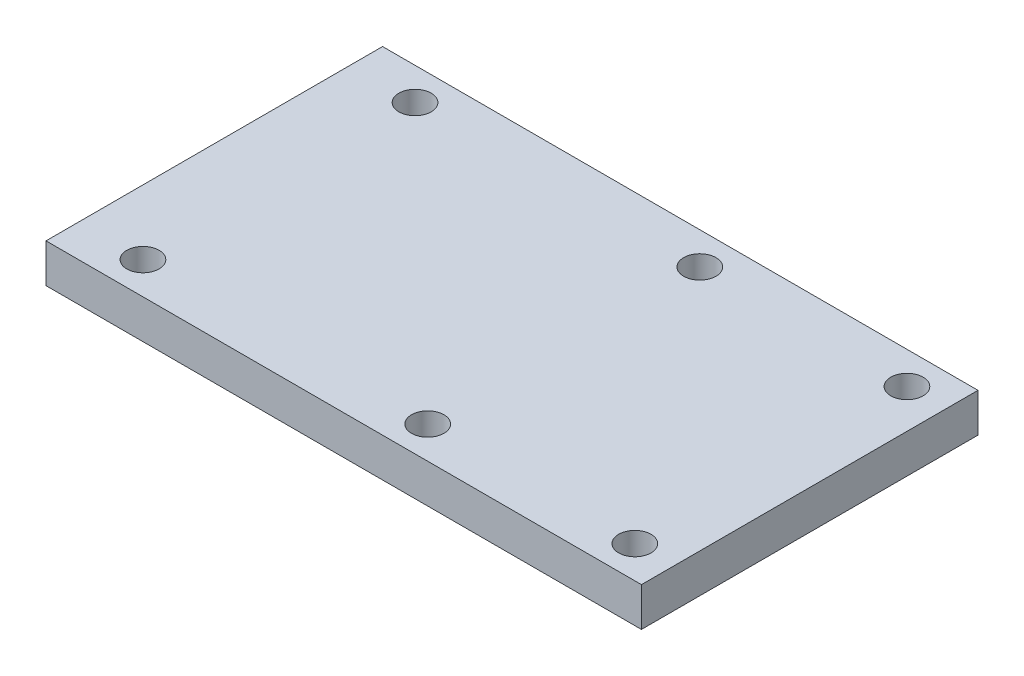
from build123d import *

# Parameters (mm, degrees)
SKETCH1_W           = 160
SKETCH1_H           = 130
BOSS_EXTRUDE1_DEPTH = 15
SKETCH2_R           = 6.25
CUT_EXTRUDE1_DEPTH  = 10
SKETCH5_R           = 4
CUT_EXTRUDE2_DEPTH  = 48
SKETCH6_W           = 130
SKETCH6_H           = 15
BOSS_EXTRUDE2_DEPTH = 70
SKETCH8_R           = 6.25
CUT_EXTRUDE3_DEPTH  = 10
SKETCH9_R           = 4
CUT_EXTRUDE6_DEPTH  = 15


with BuildPart() as part:
    # Sketch1 → Boss-Extrude1 (new body)
    with BuildSketch(Plane(origin=(0, 0, 0), x_dir=(1, 0, 0), z_dir=(0, 1, 0))):
        with Locations((-20, 5)):
            Rectangle(SKETCH1_W, SKETCH1_H)
    extrude(amount=BOSS_EXTRUDE1_DEPTH)

    # Sketch2 → Cut-Extrude1 (cut)
    with BuildSketch(Plane(origin=(0, 15, 0), x_dir=(1, 0, 0), z_dir=(0, 1, 0))):
        with Locations(Location((-75, 57.55, 0), (0, 0, 270))):
            Circle(SKETCH2_R)
        with Locations(Location((35, 57.55, 0), (0, 0, 270))):
            Circle(SKETCH2_R)
        with Locations(Location((-75, -47.55, 0), (0, 0, 270))):
            Circle(SKETCH2_R)
        with Locations(Location((35, -47.55, 0), (0, 0, 270))):
            Circle(SKETCH2_R)
    extrude(amount=-CUT_EXTRUDE1_DEPTH, mode=Mode.SUBTRACT)

    # Sketch5 → Cut-Extrude2 (cut)
    with BuildSketch(Plane(origin=(0, 15, 0), x_dir=(1, 0, 0), z_dir=(0, 1, 0))):
        with Locations(Location((-75, 57.55, 0), (0, 0, 270))):
            Circle(SKETCH5_R)
        with Locations(Location((35, 57.55, 0), (0, 0, 270))):
            Circle(SKETCH5_R)
        with Locations(Location((-75, -47.55, 0), (0, 0, 270))):
            Circle(SKETCH5_R)
        with Locations(Location((35, -47.55, 0), (0, 0, 270))):
            Circle(SKETCH5_R)
    extrude(amount=-CUT_EXTRUDE2_DEPTH, mode=Mode.SUBTRACT)

    # Sketch6 → Boss-Extrude2 (add)
    with BuildSketch(Plane(origin=(60, 0, 0), x_dir=(0, 0, -1), z_dir=(1, 0, 0))):
        with Locations((5, 7.5)):
            Rectangle(SKETCH6_W, SKETCH6_H)
    extrude(amount=BOSS_EXTRUDE2_DEPTH)

    # Sketch8 → Cut-Extrude3 (cut)
    with BuildSketch(Plane(origin=(0, 15, 0), x_dir=(1, 0, 0), z_dir=(0, 1, 0))):
        with Locations(Location((115, 57.55, 0), (0, 0, 270))):
            Circle(SKETCH8_R)
        with Locations(Location((115, -47.55, 0), (0, 0, 270))):
            Circle(SKETCH8_R)
    extrude(amount=-CUT_EXTRUDE3_DEPTH, mode=Mode.SUBTRACT)

    # Sketch9 → Cut-Extrude6 (cut)
    with BuildSketch(Plane(origin=(0, 15, 0), x_dir=(1, 0, 0), z_dir=(0, 1, 0))):
        with Locations(Location((115, 57.55, 0), (0, 0, 270))):
            Circle(SKETCH9_R)
        with Locations(Location((115, -47.55, 0), (0, 0, 270))):
            Circle(SKETCH9_R)
    extrude(amount=-CUT_EXTRUDE6_DEPTH, mode=Mode.SUBTRACT)


solid = part.part
